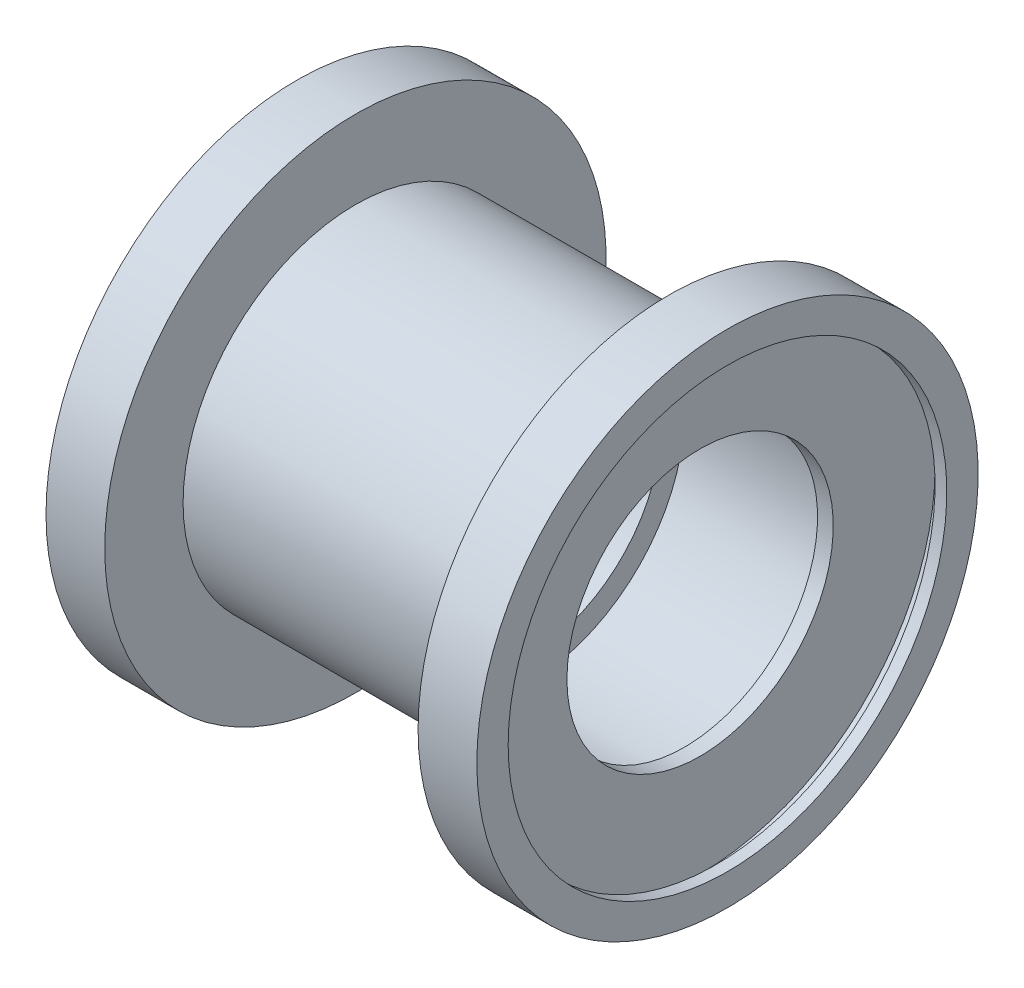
from build123d import *


with BuildPart() as part:
    # Esquisse1 → Base-R_volution (revolve)
    with BuildSketch(Plane.XY, mode=Mode.PRIVATE) as base_r_volution_sk:
        Polygon((0, 8.5), (0, 11), (10, 11), (10, 16), (13.75, 16), (13.75, 14), (13, 14), (13, 15), (12, 15), (12, 8.5), (11, 8.5), (11, 10), (1, 10), (1, 8.5), align=None)
    base_r_volution = revolve(base_r_volution_sk.sketch.rotate(Axis((0, 0, 0), (1, 0, 0)), 90), axis=Axis((0, 0, 0), (1, 0, 0)))

    # Sym_trie1: Base-R_volution across plane
    add(base_r_volution.mirror(Plane(origin=(0, 0, 0), x_dir=(0, 0, 1), z_dir=(1, 0, 0))))


solid = part.part
